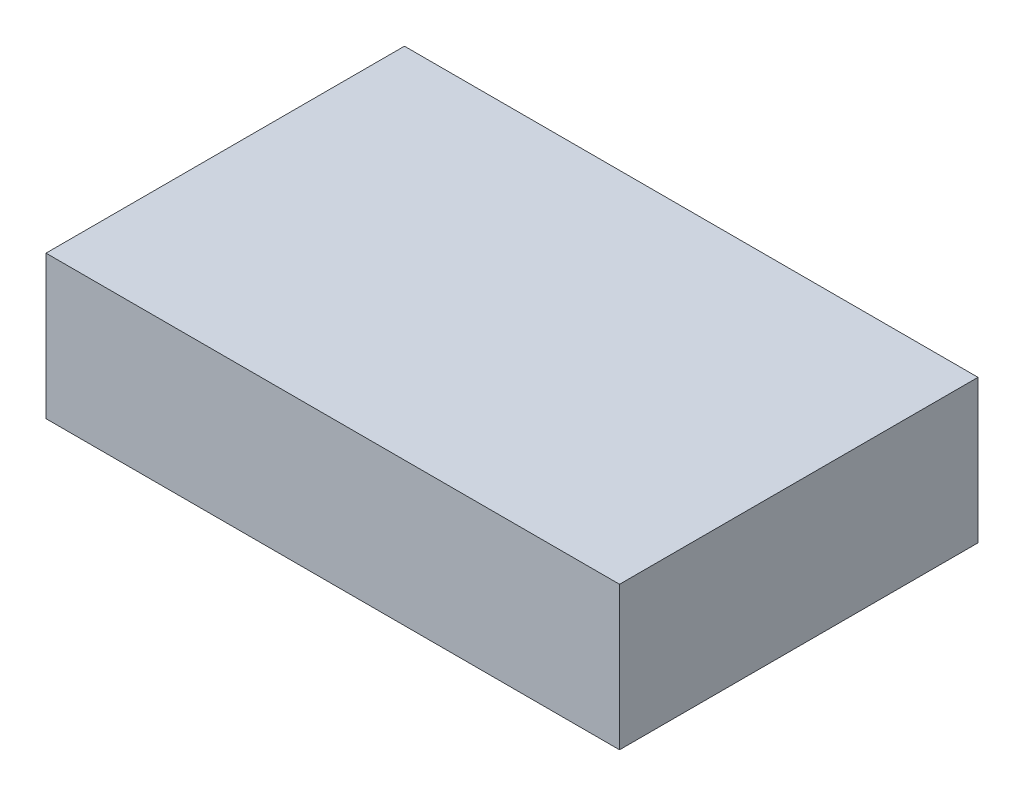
from build123d import *

# Parameters (mm, degrees)
SKETCH2_W           = 25.4
SKETCH2_H           = 15.875
BOSS_EXTRUDE1_DEPTH = 6.35


with BuildPart() as part:
    # Sketch2 → Boss-Extrude1 (new body)
    with BuildSketch(Plane(origin=(0, 0, 0), x_dir=(1, 0, 0), z_dir=(0, 1, 0))):
        with Locations((12.7, 7.9375)):
            Rectangle(SKETCH2_W, SKETCH2_H)
    extrude(amount=BOSS_EXTRUDE1_DEPTH)


solid = part.part
